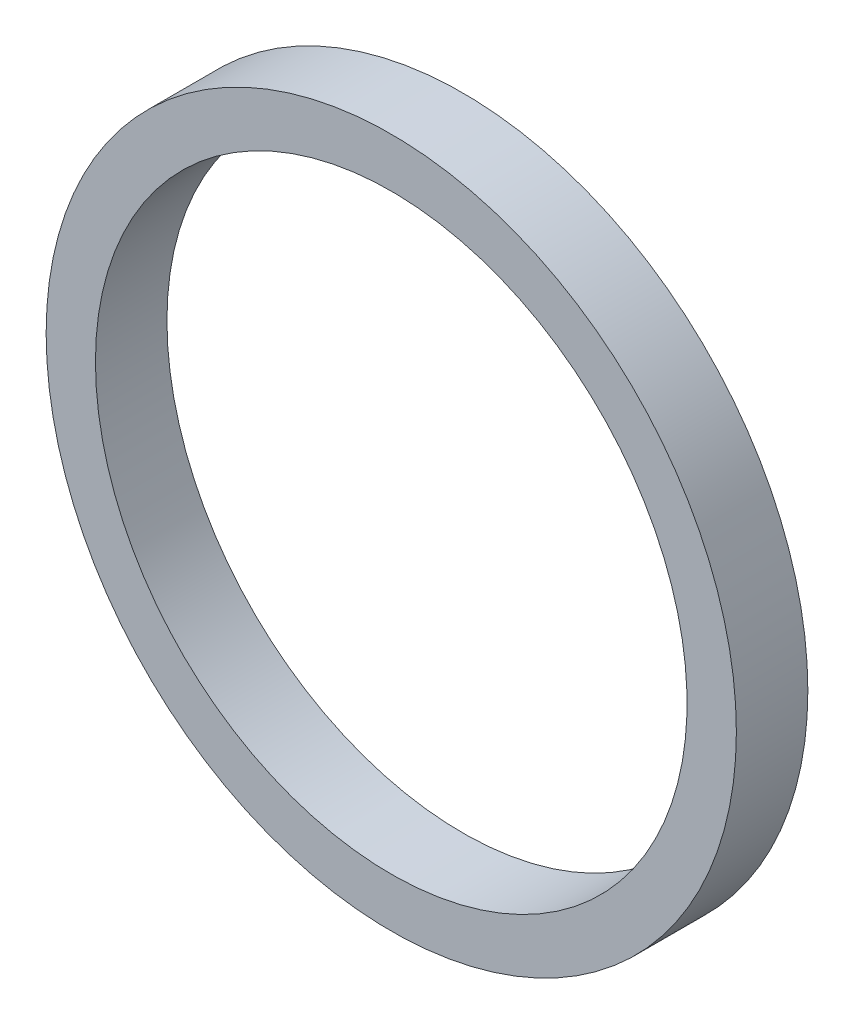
ISO-10303-21;
HEADER;
FILE_DESCRIPTION(('STEP AP214'),'2;1');
FILE_NAME('part.step','',(''),(''),'','','');
FILE_SCHEMA(('AUTOMOTIVE_DESIGN { 1 0 10303 214 1 1 1 1 }'));
ENDSEC;
DATA;
#1=APPLICATION_CONTEXT('core data for automotive mechanical design processes');
#2=APPLICATION_PROTOCOL_DEFINITION('international standard','automotive_design',2000,#1);
#3=PRODUCT_CONTEXT('',#1,'mechanical');
#4=PRODUCT('Part','Part','',(#3));
#5=PRODUCT_RELATED_PRODUCT_CATEGORY('part','',(#4));
#6=PRODUCT_DEFINITION_FORMATION('','',#4);
#7=PRODUCT_DEFINITION_CONTEXT('part definition',#1,'design');
#8=PRODUCT_DEFINITION('design','',#6,#7);
#9=PRODUCT_DEFINITION_SHAPE('','',#8);
#10=(LENGTH_UNIT() NAMED_UNIT(*) SI_UNIT(.MILLI.,.METRE.));
#11=(NAMED_UNIT(*) PLANE_ANGLE_UNIT() SI_UNIT($,.RADIAN.));
#12=(NAMED_UNIT(*) SI_UNIT($,.STERADIAN.) SOLID_ANGLE_UNIT());
#13=UNCERTAINTY_MEASURE_WITH_UNIT(LENGTH_MEASURE(1.E-05),#10,'distance_accuracy_value','');
#14=(GEOMETRIC_REPRESENTATION_CONTEXT(3) GLOBAL_UNCERTAINTY_ASSIGNED_CONTEXT((#13)) GLOBAL_UNIT_ASSIGNED_CONTEXT((#10,
#11,#12)) REPRESENTATION_CONTEXT('',''));
#15=CARTESIAN_POINT('',(0.,0.,0.));
#16=DIRECTION('',(0.,0.,1.));
#17=DIRECTION('',(1.,0.,0.));
#18=AXIS2_PLACEMENT_3D('',#15,#16,#17);
#19=CARTESIAN_POINT('',(0.,0.,7.25));
#20=DIRECTION('',(0.,0.,1.));
#21=DIRECTION('',(1.,0.,0.));
#22=AXIS2_PLACEMENT_3D('',#19,#20,#21);
#23=PLANE('',#22);
#24=CARTESIAN_POINT('',(0.,0.,7.25));
#25=DIRECTION('',(0.,0.,1.));
#26=DIRECTION('',(1.,0.,0.));
#27=AXIS2_PLACEMENT_3D('',#24,#25,#26);
#28=CIRCLE('',#27,35.);
#29=CARTESIAN_POINT('',(-35.,0.,7.25));
#30=VERTEX_POINT('',#29);
#31=EDGE_CURVE('E10',#30,#30,#28,.T.);
#32=ORIENTED_EDGE('',*,*,#31,.T.);
#33=EDGE_LOOP('',(#32));
#34=FACE_BOUND('',#33,.T.);
#35=CARTESIAN_POINT('',(0.,0.,7.25));
#36=DIRECTION('',(0.,0.,1.));
#37=DIRECTION('',(1.,0.,0.));
#38=AXIS2_PLACEMENT_3D('',#35,#36,#37);
#39=CIRCLE('',#38,30.);
#40=CARTESIAN_POINT('',(-30.,0.,7.25));
#41=VERTEX_POINT('',#40);
#42=EDGE_CURVE('E41',#41,#41,#39,.T.);
#43=ORIENTED_EDGE('',*,*,#42,.F.);
#44=EDGE_LOOP('',(#43));
#45=FACE_BOUND('',#44,.T.);
#46=ADVANCED_FACE('F30',(#34,#45),#23,.T.);
#47=CARTESIAN_POINT('',(0.,0.,0.));
#48=DIRECTION('',(0.,0.,1.));
#49=DIRECTION('',(1.,0.,0.));
#50=AXIS2_PLACEMENT_3D('',#47,#48,#49);
#51=PLANE('',#50);
#52=CARTESIAN_POINT('',(0.,0.,0.));
#53=DIRECTION('',(0.,0.,1.));
#54=DIRECTION('',(1.,0.,0.));
#55=AXIS2_PLACEMENT_3D('',#52,#53,#54);
#56=CIRCLE('',#55,35.);
#57=CARTESIAN_POINT('',(-35.,0.,0.));
#58=VERTEX_POINT('',#57);
#59=EDGE_CURVE('E34',#58,#58,#56,.T.);
#60=ORIENTED_EDGE('',*,*,#59,.F.);
#61=EDGE_LOOP('',(#60));
#62=FACE_BOUND('',#61,.T.);
#63=CARTESIAN_POINT('',(0.,0.,0.));
#64=DIRECTION('',(0.,0.,1.));
#65=DIRECTION('',(1.,0.,0.));
#66=AXIS2_PLACEMENT_3D('',#63,#64,#65);
#67=CIRCLE('',#66,30.);
#68=CARTESIAN_POINT('',(-30.,0.,0.));
#69=VERTEX_POINT('',#68);
#70=EDGE_CURVE('E43',#69,#69,#67,.T.);
#71=ORIENTED_EDGE('',*,*,#70,.T.);
#72=EDGE_LOOP('',(#71));
#73=FACE_BOUND('',#72,.T.);
#74=ADVANCED_FACE('F53',(#62,#73),#51,.F.);
#75=CARTESIAN_POINT('',(0.,0.,7.25));
#76=DIRECTION('',(0.,0.,-1.));
#77=DIRECTION('',(-1.,0.,0.));
#78=AXIS2_PLACEMENT_3D('',#75,#76,#77);
#79=CYLINDRICAL_SURFACE('',#78,35.);
#80=CARTESIAN_POINT('',(-35.,0.,7.25));
#81=CARTESIAN_POINT('',(-35.,0.,7.17447916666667));
#82=CARTESIAN_POINT('',(-35.,0.,7.09895833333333));
#83=CARTESIAN_POINT('',(-35.,0.,6.94791666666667));
#84=CARTESIAN_POINT('',(-35.,0.,6.87239583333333));
#85=CARTESIAN_POINT('',(-35.,0.,6.72135416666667));
#86=CARTESIAN_POINT('',(-35.,0.,6.64583333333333));
#87=CARTESIAN_POINT('',(-35.,0.,6.49479166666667));
#88=CARTESIAN_POINT('',(-35.,0.,6.41927083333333));
#89=CARTESIAN_POINT('',(-35.,0.,6.26822916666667));
#90=CARTESIAN_POINT('',(-35.,0.,6.19270833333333));
#91=CARTESIAN_POINT('',(-35.,0.,6.04166666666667));
#92=CARTESIAN_POINT('',(-35.,0.,5.96614583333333));
#93=CARTESIAN_POINT('',(-35.,0.,5.81510416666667));
#94=CARTESIAN_POINT('',(-35.,0.,5.73958333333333));
#95=CARTESIAN_POINT('',(-35.,0.,5.58854166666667));
#96=CARTESIAN_POINT('',(-35.,0.,5.51302083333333));
#97=CARTESIAN_POINT('',(-35.,0.,5.36197916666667));
#98=CARTESIAN_POINT('',(-35.,0.,5.28645833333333));
#99=CARTESIAN_POINT('',(-35.,0.,5.13541666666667));
#100=CARTESIAN_POINT('',(-35.,0.,5.05989583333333));
#101=CARTESIAN_POINT('',(-35.,0.,4.90885416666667));
#102=CARTESIAN_POINT('',(-35.,0.,4.83333333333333));
#103=CARTESIAN_POINT('',(-35.,0.,4.68229166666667));
#104=CARTESIAN_POINT('',(-35.,0.,4.60677083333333));
#105=CARTESIAN_POINT('',(-35.,0.,4.45572916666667));
#106=CARTESIAN_POINT('',(-35.,0.,4.38020833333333));
#107=CARTESIAN_POINT('',(-35.,0.,4.22916666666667));
#108=CARTESIAN_POINT('',(-35.,0.,4.15364583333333));
#109=CARTESIAN_POINT('',(-35.,0.,4.00260416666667));
#110=CARTESIAN_POINT('',(-35.,0.,3.92708333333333));
#111=CARTESIAN_POINT('',(-35.,0.,3.77604166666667));
#112=CARTESIAN_POINT('',(-35.,0.,3.70052083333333));
#113=CARTESIAN_POINT('',(-35.,0.,3.54947916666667));
#114=CARTESIAN_POINT('',(-35.,0.,3.47395833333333));
#115=CARTESIAN_POINT('',(-35.,0.,3.32291666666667));
#116=CARTESIAN_POINT('',(-35.,0.,3.24739583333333));
#117=CARTESIAN_POINT('',(-35.,0.,3.09635416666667));
#118=CARTESIAN_POINT('',(-35.,0.,3.02083333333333));
#119=CARTESIAN_POINT('',(-35.,0.,2.86979166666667));
#120=CARTESIAN_POINT('',(-35.,0.,2.79427083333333));
#121=CARTESIAN_POINT('',(-35.,0.,2.64322916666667));
#122=CARTESIAN_POINT('',(-35.,0.,2.56770833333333));
#123=CARTESIAN_POINT('',(-35.,0.,2.41666666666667));
#124=CARTESIAN_POINT('',(-35.,0.,2.34114583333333));
#125=CARTESIAN_POINT('',(-35.,0.,2.19010416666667));
#126=CARTESIAN_POINT('',(-35.,0.,2.11458333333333));
#127=CARTESIAN_POINT('',(-35.,0.,1.96354166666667));
#128=CARTESIAN_POINT('',(-35.,0.,1.88802083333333));
#129=CARTESIAN_POINT('',(-35.,0.,1.73697916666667));
#130=CARTESIAN_POINT('',(-35.,0.,1.66145833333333));
#131=CARTESIAN_POINT('',(-35.,0.,1.51041666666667));
#132=CARTESIAN_POINT('',(-35.,0.,1.43489583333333));
#133=CARTESIAN_POINT('',(-35.,0.,1.28385416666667));
#134=CARTESIAN_POINT('',(-35.,0.,1.20833333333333));
#135=CARTESIAN_POINT('',(-35.,0.,1.05729166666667));
#136=CARTESIAN_POINT('',(-35.,0.,0.981770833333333));
#137=CARTESIAN_POINT('',(-35.,0.,0.830729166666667));
#138=CARTESIAN_POINT('',(-35.,0.,0.755208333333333));
#139=CARTESIAN_POINT('',(-35.,0.,0.604166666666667));
#140=CARTESIAN_POINT('',(-35.,0.,0.528645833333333));
#141=CARTESIAN_POINT('',(-35.,0.,0.377604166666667));
#142=CARTESIAN_POINT('',(-35.,0.,0.302083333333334));
#143=CARTESIAN_POINT('',(-35.,0.,0.151041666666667));
#144=CARTESIAN_POINT('',(-35.,0.,0.0755208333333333));
#145=CARTESIAN_POINT('',(-35.,0.,0.));
#146=B_SPLINE_CURVE_WITH_KNOTS('',3,(#80,#81,#82,#83,#84,#85,#86,#87,#88,#89,#90,#91,#92,#93,
#94,#95,#96,#97,#98,#99,#100,#101,#102,#103,#104,#105,#106,#107,#108,#109,#110,#111,#112,#113,
#114,#115,#116,#117,#118,#119,#120,#121,#122,#123,#124,#125,#126,#127,#128,#129,#130,#131,#132,
#133,#134,#135,#136,#137,#138,#139,#140,#141,#142,#143,#144,#145),.UNSPECIFIED.,.F.,.F.,(4,2,2,
2,2,2,2,2,2,2,2,2,2,2,2,2,2,2,2,2,2,2,2,2,2,2,2,2,2,2,2,2,4),(0.,0.226562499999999,0.453125,
0.6796875,0.906249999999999,1.1328125,1.359375,1.5859375,1.8125,2.0390625,2.265625,2.4921875,
2.71875,2.9453125,3.171875,3.3984375,3.625,3.8515625,4.078125,4.3046875,4.53125,4.7578125,
4.984375,5.2109375,5.4375,5.6640625,5.890625,6.1171875,6.34375,6.5703125,6.796875,7.0234375,
7.25),.UNSPECIFIED.);
#147=EDGE_CURVE('BSEAM32',#30,#58,#146,.T.);
#148=ORIENTED_EDGE('',*,*,#31,.F.);
#149=ORIENTED_EDGE('',*,*,#59,.T.);
#150=ORIENTED_EDGE('',*,*,#147,.T.);
#151=ORIENTED_EDGE('',*,*,#147,.F.);
#152=EDGE_LOOP('',(#148,#150,#149,#151));
#153=FACE_BOUND('',#152,.T.);
#154=ADVANCED_FACE('F32',(#153),#79,.T.);
#155=CARTESIAN_POINT('',(0.,0.,7.25));
#156=DIRECTION('',(0.,0.,-1.));
#157=DIRECTION('',(-1.,0.,0.));
#158=AXIS2_PLACEMENT_3D('',#155,#156,#157);
#159=CYLINDRICAL_SURFACE('',#158,30.);
#160=CARTESIAN_POINT('',(-30.,0.,7.25));
#161=CARTESIAN_POINT('',(-30.,0.,7.17447916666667));
#162=CARTESIAN_POINT('',(-30.,0.,7.09895833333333));
#163=CARTESIAN_POINT('',(-30.,0.,6.94791666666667));
#164=CARTESIAN_POINT('',(-30.,0.,6.87239583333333));
#165=CARTESIAN_POINT('',(-30.,0.,6.72135416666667));
#166=CARTESIAN_POINT('',(-30.,0.,6.64583333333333));
#167=CARTESIAN_POINT('',(-30.,0.,6.49479166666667));
#168=CARTESIAN_POINT('',(-30.,0.,6.41927083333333));
#169=CARTESIAN_POINT('',(-30.,0.,6.26822916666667));
#170=CARTESIAN_POINT('',(-30.,0.,6.19270833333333));
#171=CARTESIAN_POINT('',(-30.,0.,6.04166666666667));
#172=CARTESIAN_POINT('',(-30.,0.,5.96614583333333));
#173=CARTESIAN_POINT('',(-30.,0.,5.81510416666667));
#174=CARTESIAN_POINT('',(-30.,0.,5.73958333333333));
#175=CARTESIAN_POINT('',(-30.,0.,5.58854166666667));
#176=CARTESIAN_POINT('',(-30.,0.,5.51302083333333));
#177=CARTESIAN_POINT('',(-30.,0.,5.36197916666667));
#178=CARTESIAN_POINT('',(-30.,0.,5.28645833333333));
#179=CARTESIAN_POINT('',(-30.,0.,5.13541666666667));
#180=CARTESIAN_POINT('',(-30.,0.,5.05989583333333));
#181=CARTESIAN_POINT('',(-30.,0.,4.90885416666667));
#182=CARTESIAN_POINT('',(-30.,0.,4.83333333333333));
#183=CARTESIAN_POINT('',(-30.,0.,4.68229166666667));
#184=CARTESIAN_POINT('',(-30.,0.,4.60677083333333));
#185=CARTESIAN_POINT('',(-30.,0.,4.45572916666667));
#186=CARTESIAN_POINT('',(-30.,0.,4.38020833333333));
#187=CARTESIAN_POINT('',(-30.,0.,4.22916666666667));
#188=CARTESIAN_POINT('',(-30.,0.,4.15364583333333));
#189=CARTESIAN_POINT('',(-30.,0.,4.00260416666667));
#190=CARTESIAN_POINT('',(-30.,0.,3.92708333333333));
#191=CARTESIAN_POINT('',(-30.,0.,3.77604166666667));
#192=CARTESIAN_POINT('',(-30.,0.,3.70052083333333));
#193=CARTESIAN_POINT('',(-30.,0.,3.54947916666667));
#194=CARTESIAN_POINT('',(-30.,0.,3.47395833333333));
#195=CARTESIAN_POINT('',(-30.,0.,3.32291666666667));
#196=CARTESIAN_POINT('',(-30.,0.,3.24739583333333));
#197=CARTESIAN_POINT('',(-30.,0.,3.09635416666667));
#198=CARTESIAN_POINT('',(-30.,0.,3.02083333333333));
#199=CARTESIAN_POINT('',(-30.,0.,2.86979166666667));
#200=CARTESIAN_POINT('',(-30.,0.,2.79427083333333));
#201=CARTESIAN_POINT('',(-30.,0.,2.64322916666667));
#202=CARTESIAN_POINT('',(-30.,0.,2.56770833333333));
#203=CARTESIAN_POINT('',(-30.,0.,2.41666666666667));
#204=CARTESIAN_POINT('',(-30.,0.,2.34114583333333));
#205=CARTESIAN_POINT('',(-30.,0.,2.19010416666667));
#206=CARTESIAN_POINT('',(-30.,0.,2.11458333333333));
#207=CARTESIAN_POINT('',(-30.,0.,1.96354166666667));
#208=CARTESIAN_POINT('',(-30.,0.,1.88802083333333));
#209=CARTESIAN_POINT('',(-30.,0.,1.73697916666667));
#210=CARTESIAN_POINT('',(-30.,0.,1.66145833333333));
#211=CARTESIAN_POINT('',(-30.,0.,1.51041666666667));
#212=CARTESIAN_POINT('',(-30.,0.,1.43489583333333));
#213=CARTESIAN_POINT('',(-30.,0.,1.28385416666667));
#214=CARTESIAN_POINT('',(-30.,0.,1.20833333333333));
#215=CARTESIAN_POINT('',(-30.,0.,1.05729166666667));
#216=CARTESIAN_POINT('',(-30.,0.,0.981770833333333));
#217=CARTESIAN_POINT('',(-30.,0.,0.830729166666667));
#218=CARTESIAN_POINT('',(-30.,0.,0.755208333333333));
#219=CARTESIAN_POINT('',(-30.,0.,0.604166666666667));
#220=CARTESIAN_POINT('',(-30.,0.,0.528645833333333));
#221=CARTESIAN_POINT('',(-30.,0.,0.377604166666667));
#222=CARTESIAN_POINT('',(-30.,0.,0.302083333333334));
#223=CARTESIAN_POINT('',(-30.,0.,0.151041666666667));
#224=CARTESIAN_POINT('',(-30.,0.,0.0755208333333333));
#225=CARTESIAN_POINT('',(-30.,0.,0.));
#226=B_SPLINE_CURVE_WITH_KNOTS('',3,(#160,#161,#162,#163,#164,#165,#166,#167,#168,#169,#170,
#171,#172,#173,#174,#175,#176,#177,#178,#179,#180,#181,#182,#183,#184,#185,#186,#187,#188,#189,
#190,#191,#192,#193,#194,#195,#196,#197,#198,#199,#200,#201,#202,#203,#204,#205,#206,#207,#208,
#209,#210,#211,#212,#213,#214,#215,#216,#217,#218,#219,#220,#221,#222,#223,#224,#225),
.UNSPECIFIED.,.F.,.F.,(4,2,2,2,2,2,2,2,2,2,2,2,2,2,2,2,2,2,2,2,2,2,2,2,2,2,2,2,2,2,2,2,4),(0.,
0.2265625,0.453125,0.679687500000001,0.906250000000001,1.1328125,1.359375,1.5859375,1.8125,
2.0390625,2.265625,2.4921875,2.71875,2.9453125,3.171875,3.3984375,3.625,3.8515625,4.078125,
4.3046875,4.53125,4.7578125,4.984375,5.2109375,5.4375,5.6640625,5.890625,6.1171875,6.34375,
6.5703125,6.796875,7.0234375,7.25),.UNSPECIFIED.);
#227=EDGE_CURVE('BSEAM49',#41,#69,#226,.T.);
#228=ORIENTED_EDGE('',*,*,#42,.T.);
#229=ORIENTED_EDGE('',*,*,#70,.F.);
#230=ORIENTED_EDGE('',*,*,#227,.T.);
#231=ORIENTED_EDGE('',*,*,#227,.F.);
#232=EDGE_LOOP('',(#228,#230,#229,#231));
#233=FACE_BOUND('',#232,.T.);
#234=ADVANCED_FACE('F49',(#233),#159,.F.);
#235=CLOSED_SHELL('',(#46,#74,#154,#234));
#236=MANIFOLD_SOLID_BREP('B2',#235);
#237=ADVANCED_BREP_SHAPE_REPRESENTATION('',(#18,#236),#14);
#238=SHAPE_DEFINITION_REPRESENTATION(#9,#237);
ENDSEC;
END-ISO-10303-21;
